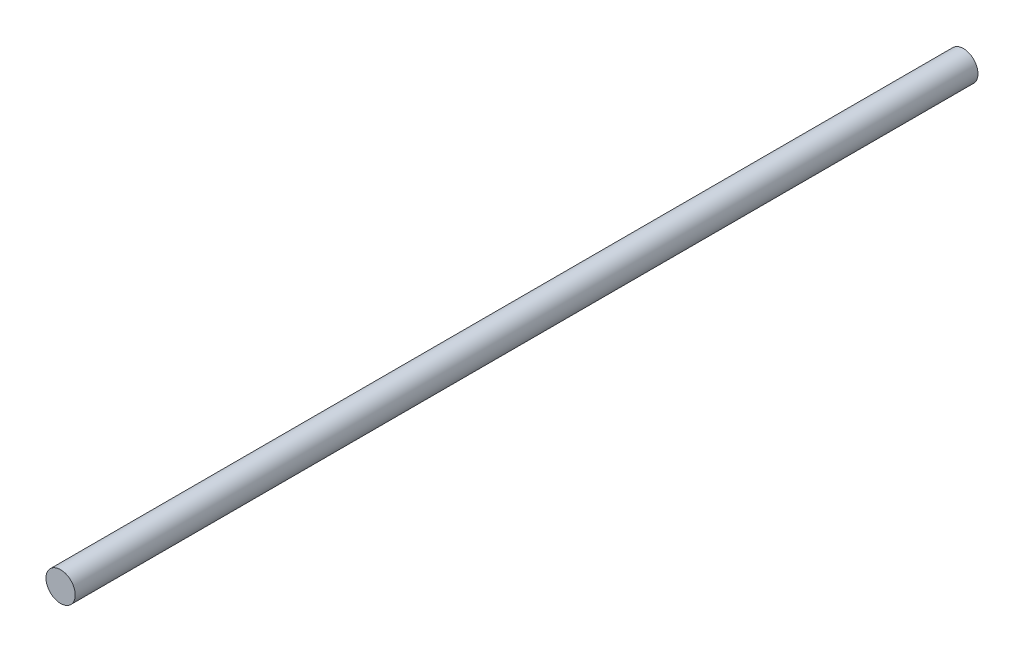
from build123d import *

# Parameters (mm, degrees)
SKETCH1_R           = 30
BOSS_EXTRUDE1_DEPTH = 1850


with BuildPart() as part:
    # Sketch1 → Boss-Extrude1 (new body)
    with BuildSketch(Plane.XY):
        Circle(SKETCH1_R)
    extrude(amount=-BOSS_EXTRUDE1_DEPTH)


solid = part.part
